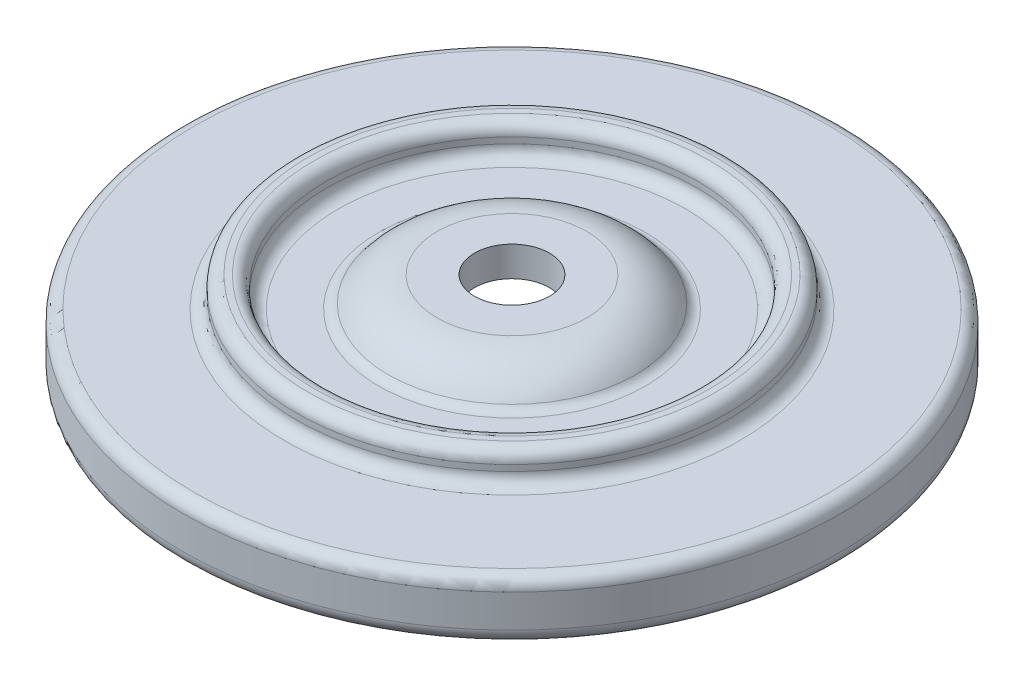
from build123d import *

# Parameters (mm, degrees)
FILLET1_R           = 0.635
FILLET4_R           = 0.508
FILLET5_R           = 0.508
FILLET6_R           = 1.27
FILLET7_R           = 0.508
SKETCH4_R           = 1.5875
MOUNTING_HOLE_DEPTH = 21.120584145


with BuildPart() as part:
    # Sketch1 → Outside body (revolve)
    with BuildSketch(Plane.XY, mode=Mode.PRIVATE) as outside_body_sk:
        Polygon((0, 0), (9.144, 0), (9.144, -1.27), (13.97, -1.27), (13.97, -3.81), (0, -3.81), align=None)
    revolve(outside_body_sk.sketch.rotate(Axis((0, 0, 0), (0, 1, 0)), 90), axis=Axis((0, 0, 0), (0, 1, 0)))

    # Sketch2 → Top (revolve, cut)
    with BuildSketch(Plane.XY, mode=Mode.PRIVATE) as top_sk:
        with BuildLine():
            Line((7.874, 0), (7.874, -1.27))
            Line((7.874, -1.27), (5.374704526, -1.27))
            ThreePointArc((5.374704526, -1.27), (4.445, -0.340295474), (3.175, 0))
            Line((3.175, 0), (7.874, 0))
        make_face()
    revolve(top_sk.sketch.rotate(Axis((0, 0, 0), (0, -1, 0)), 90), axis=Axis((0, 0, 0), (0, -1, 0)), mode=Mode.SUBTRACT)

    # Sketch3 → Bottom (revolve, cut)
    with BuildSketch(Plane.XY, mode=Mode.PRIVATE) as bottom_sk:
        with BuildLine():
            Line((12.7, -3.81), (0, -3.81))
            Line((0, -3.81), (0, -1.27))
            Line((0, -1.27), (3.175, -1.27))
            ThreePointArc((3.175, -1.27), (4.237558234, -1.844392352), (4.338974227, -3.048))
            Line((4.338974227, -3.048), (12.7, -3.048))
            Line((12.7, -3.048), (12.7, -3.81))
        make_face()
    revolve(bottom_sk.sketch.rotate(Axis((0, 0, 0), (0, -1, 0)), 90), axis=Axis((0, 0, 0), (0, -1, 0)), mode=Mode.SUBTRACT)

    # Fillet1
    fillet1_edges = [part.edges().sort_by_distance(p)[0] for p in [
        (0, -3.81, 13.97),
    ]]
    fillet(fillet1_edges, radius=FILLET1_R)

    # Fillet4
    fillet4_edges = [part.edges().sort_by_distance(p)[0] for p in [
        (0, -3.81, -12.7),
    ]]
    fillet(fillet4_edges, radius=FILLET4_R)

    # Fillet5
    fillet5_edges = [part.edges().sort_by_distance(p)[0] for p in [
        (0, -3.048, -12.7),
        (0, -3.302, -12.7),
    ]]
    fillet(fillet5_edges, radius=FILLET5_R)

    # Fillet6
    fillet6_edges = [part.edges().sort_by_distance(p)[0] for p in [
        (0, -3.048, -4.338974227),
    ]]
    fillet(fillet6_edges, radius=FILLET6_R)

    # Fillet7
    fillet7_edges = [part.edges().sort_by_distance(p)[0] for p in [
        (0, 0, -7.874),
        (0, -1.27, -5.374704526),
        (0, -1.27, -7.874),
        (0, -1.27, 13.97),
        (0, -1.27, 9.144),
        (0, 0, 9.144),
    ]]
    fillet(fillet7_edges, radius=FILLET7_R)

    # Sketch4 → Mounting Hole (cut, through all)
    with BuildSketch(Plane(origin=(0, 0, 0), x_dir=(-1, 0, 0), z_dir=(0, 1, 0))):
        with Locations(Location((0, 0, 0), (0, 0, 90))):
            Circle(SKETCH4_R)
    extrude(amount=-MOUNTING_HOLE_DEPTH, mode=Mode.SUBTRACT)


solid = part.part
